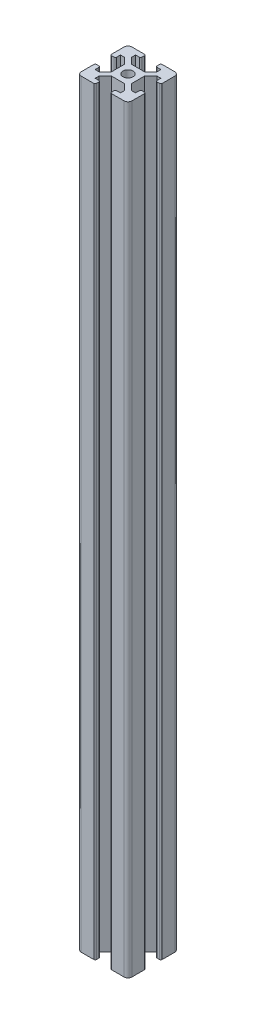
from build123d import *

# Parameters (mm, degrees)
CROQUIS1_R              = 2
SALIENTE_EXTRUIR1_DEPTH = 300
REDONDEO1_R             = 1.5
REDONDEO2_R             = 0.5


with BuildPart() as part:
    # Croquis1 → Saliente-Extruir1 (new body)
    with BuildSketch(Plane(origin=(0, 0, 0), x_dir=(1, 0, 0), z_dir=(0, 1, 0))):
        Polygon((-10, 10), (-3, 10), (-3, 8), (-5, 8), (-5, 6.414213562), (-2.585786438, 4), (2.585786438, 4), (5, 6.414213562), (5, 8), (3, 8), (3, 10), (10, 10), (10, 3), (8, 3), (8, 5), (6.414213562, 5), (4, 2.585786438), (4, -2.585786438), (6.414213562, -5), (8, -5), (8, -3), (10, -3), (10, -10), (3, -10), (3, -8), (5, -8), (5, -6.414213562), (2.585786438, -4), (-2.585786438, -4), (-5, -6.414213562), (-5, -8), (-3, -8), (-3, -10), (-10, -10), (-10, -3), (-8, -3), (-8, -5), (-6.414213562, -5), (-4, -2.585786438), (-4, 2.585786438), (-6.414213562, 5), (-8, 5), (-8, 3), (-10, 3), align=None)
        with Locations(Location((0, 0, 0), (0, 0, 270))):
            Circle(CROQUIS1_R, mode=Mode.SUBTRACT)
    extrude(amount=SALIENTE_EXTRUIR1_DEPTH)

    # Redondeo1
    redondeo1_edges = [part.edges().sort_by_distance(p)[0] for p in [
        (10, 150, 10),
        (-10, 150, 10),
        (-10, 150, -10),
        (10, 150, -10),
    ]]
    fillet(redondeo1_edges, radius=REDONDEO1_R)

    # Redondeo2
    redondeo2_edges = [part.edges().sort_by_distance(p)[0] for p in [
        (10, 150, -3),
        (8, 150, -3),
        (8, 150, 3),
        (10, 150, 3),
        (3, 150, 10),
        (3, 150, 8),
        (-3, 150, 8),
        (-3, 150, 10),
        (-10, 150, 3),
        (-8, 150, 3),
        (-8, 150, -3),
        (-10, 150, -3),
        (-3, 150, -10),
        (-3, 150, -8),
        (3, 150, -8),
        (3, 150, -10),
    ]]
    fillet(redondeo2_edges, radius=REDONDEO2_R)


solid = part.part
